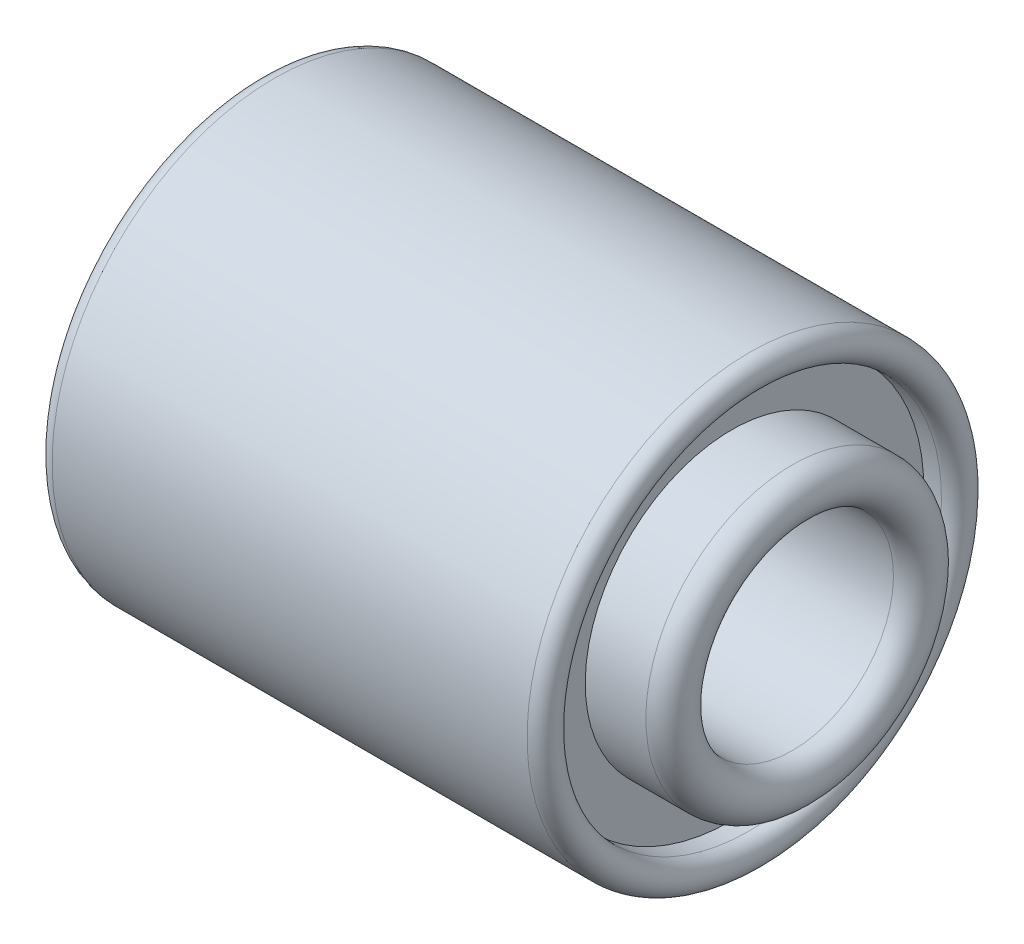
from build123d import *


with BuildPart() as part:
    # Esquisse1 → Base-R_volution (revolve)
    with BuildSketch(Plane.XY, mode=Mode.PRIVATE) as base_r_volution_sk:
        with BuildLine():
            Line((-13.875, 5), (13.875, 5))
            ThreePointArc((13.875, 5), (15, 6.125), (13.875, 7.25))
            Line((13.875, 7.25), (10.875, 7.25))
            Line((10.875, 7.25), (10.875, 9.5))
            Line((10.875, 9.5), (11.75, 9.5))
            ThreePointArc((11.75, 9.5), (12.5, 10.25), (11.75, 11))
            Line((11.75, 11), (-11.75, 11))
            ThreePointArc((-11.75, 11), (-12.5, 10.25), (-11.75, 9.5))
            Line((-11.75, 9.5), (-10.875, 9.5))
            Line((-10.875, 9.5), (-10.875, 7.25))
            Line((-10.875, 7.25), (-13.875, 7.25))
            ThreePointArc((-13.875, 7.25), (-15, 6.125), (-13.875, 5))
        make_face()
    revolve(base_r_volution_sk.sketch.rotate(Axis((-35.530635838, 0, 0), (1, 0, 0)), 180), axis=Axis((-35.530635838, 0, 0), (1, 0, 0)))


solid = part.part
